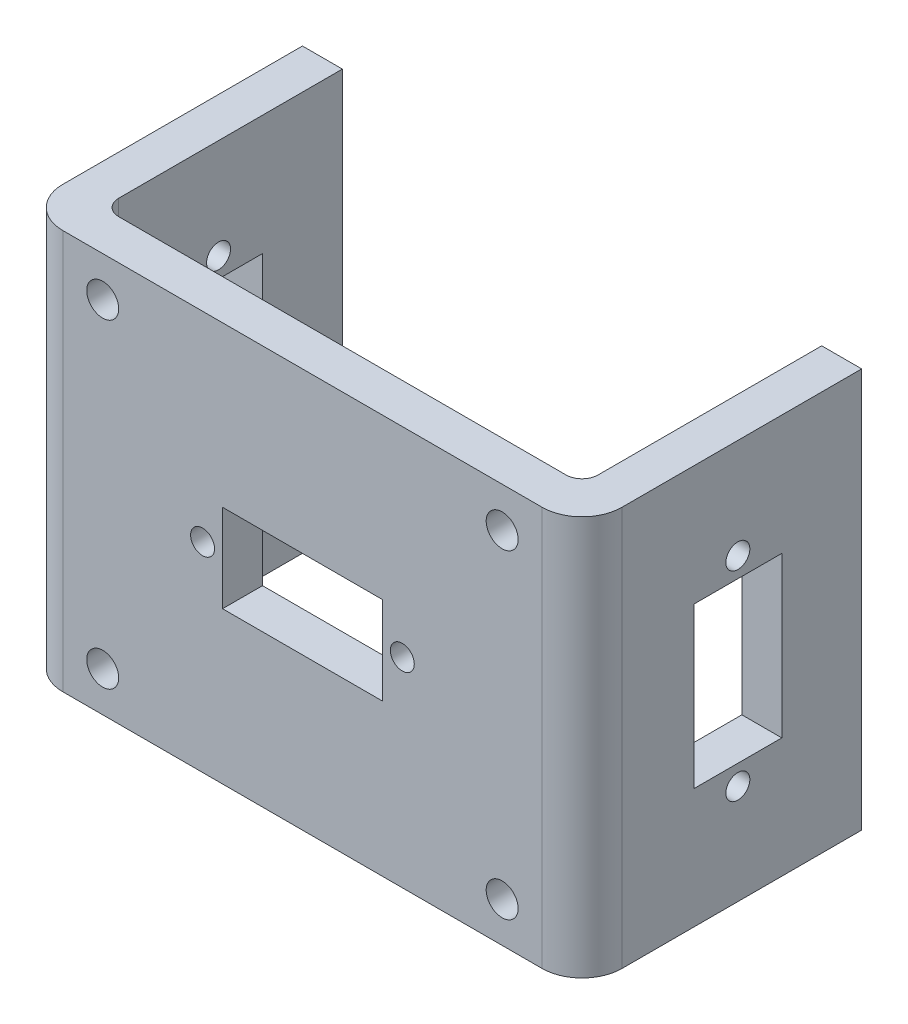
from build123d import *

# Parameters (mm, degrees)
ESQUISSE1_W      = 70
ESQUISSE1_H      = 50
EXTRUSION1_DEPTH = 35
CONG_1_R         = 5
EXTRUSION2_DEPTH = 93.870878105
EXTRUSION3_REACH = 94.871
ESQUISSE3_R      = 2
ESQUISSE5_R      = 1.5
ESQUISSE5_W      = 11
ESQUISSE5_H      = 20
EXTRUSION4_DEPTH = 93.870878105
EXTRUSION6_REACH = 94.871
ESQUISSE7_R      = 1.5
ESQUISSE7_W      = 20
ESQUISSE7_H      = 11


with BuildPart() as part:
    # Esquisse1 → Extrusion1 (new body)
    with BuildSketch(Plane.XY):
        with Locations((35, 25)):
            Rectangle(ESQUISSE1_W, ESQUISSE1_H)
    extrude(amount=EXTRUSION1_DEPTH)

    # Cong_1
    cong_1_edges = [part.edges().sort_by_distance(p)[0] for p in [
        (70, 25, 35),
        (0, 25, 35),
    ]]
    fillet(cong_1_edges, radius=CONG_1_R)

    # Esquisse2 → Extrusion2 (cut, through all)
    with BuildSketch(Plane(origin=(0, 50, 0), x_dir=(1, 0, 0), z_dir=(0, 1, 0))):
        with BuildLine():
            Line((65, 0), (5, 0))
            Line((5, 0), (5, -28))
            ThreePointArc((5, -28), (5.585786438, -29.414213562), (7, -30))
            Line((7, -30), (63, -30))
            ThreePointArc((63, -30), (64.414213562, -29.414213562), (65, -28))
            Line((65, -28), (65, 0))
        make_face()
    extrude(amount=-EXTRUSION2_DEPTH, mode=Mode.SUBTRACT)

    # Esquisse3 → Extrusion3 (cut, up to next)
    with BuildSketch(Plane.XY.offset(35), mode=Mode.PRIVATE) as extrusion3_sk1:
        with Locations((10, 45)):
            Circle(ESQUISSE3_R)
    extrusion3_tool1 = extrude(extrusion3_sk1.sketch, amount=-EXTRUSION3_REACH, mode=Mode.PRIVATE) & part.part
    # Esquisse3 → Extrusion3 (cut, up to next)
    with BuildSketch(Plane.XY.offset(35), mode=Mode.PRIVATE) as extrusion3_sk2:
        with Locations((10, 5)):
            Circle(ESQUISSE3_R)
    extrusion3_tool2 = extrude(extrusion3_sk2.sketch, amount=-EXTRUSION3_REACH, mode=Mode.PRIVATE) & part.part
    # Esquisse3 → Extrusion3 (cut, up to next)
    with BuildSketch(Plane.XY.offset(35), mode=Mode.PRIVATE) as extrusion3_sk3:
        with Locations((60, 5)):
            Circle(ESQUISSE3_R)
    extrusion3_tool3 = extrude(extrusion3_sk3.sketch, amount=-EXTRUSION3_REACH, mode=Mode.PRIVATE) & part.part
    # Esquisse3 → Extrusion3 (cut, up to next)
    with BuildSketch(Plane.XY.offset(35), mode=Mode.PRIVATE) as extrusion3_sk4:
        with Locations((60, 45)):
            Circle(ESQUISSE3_R)
    extrusion3_tool4 = extrude(extrusion3_sk4.sketch, amount=-EXTRUSION3_REACH, mode=Mode.PRIVATE) & part.part
    add(extrusion3_tool1.solids().sort_by_distance((10, 45, 35))[0], mode=Mode.SUBTRACT)
    add(extrusion3_tool2.solids().sort_by_distance((10, 5, 35))[0], mode=Mode.SUBTRACT)
    add(extrusion3_tool3.solids().sort_by_distance((60, 5, 35))[0], mode=Mode.SUBTRACT)
    add(extrusion3_tool4.solids().sort_by_distance((60, 45, 35))[0], mode=Mode.SUBTRACT)

    # Esquisse5 → Extrusion4 (cut, through all)
    with BuildSketch(Plane.ZY):
        with Locations(Location((15.5, 12.5, 0), (0, 0, 270))):
            Circle(ESQUISSE5_R)
        with Locations(Location((15.5, 37.5, 0), (0, 0, 270))):
            Circle(ESQUISSE5_R)
        with Locations((15.5, 25)):
            Rectangle(ESQUISSE5_W, ESQUISSE5_H)
    extrude(amount=-EXTRUSION4_DEPTH, mode=Mode.SUBTRACT)

    # Esquisse7 → Extrusion6 (cut, up to next)
    with BuildSketch(Plane.XY.offset(35), mode=Mode.PRIVATE) as extrusion6_sk1:
        with Locations((22.5, 25)):
            Circle(ESQUISSE7_R)
    extrusion6_tool1 = extrude(extrusion6_sk1.sketch, amount=-EXTRUSION6_REACH, mode=Mode.PRIVATE) & part.part
    # Esquisse7 → Extrusion6 (cut, up to next)
    with BuildSketch(Plane.XY.offset(35), mode=Mode.PRIVATE) as extrusion6_sk2:
        with Locations((47.5, 25)):
            Circle(ESQUISSE7_R)
    extrusion6_tool2 = extrude(extrusion6_sk2.sketch, amount=-EXTRUSION6_REACH, mode=Mode.PRIVATE) & part.part
    # Esquisse7 → Extrusion6 (cut, up to next)
    with BuildSketch(Plane.XY.offset(35), mode=Mode.PRIVATE) as extrusion6_sk3:
        with Locations((35, 24.5)):
            Rectangle(ESQUISSE7_W, ESQUISSE7_H)
    extrusion6_tool3 = extrude(extrusion6_sk3.sketch, amount=-EXTRUSION6_REACH, mode=Mode.PRIVATE) & part.part
    add(extrusion6_tool1.solids().sort_by_distance((22.5, 25, 35))[0], mode=Mode.SUBTRACT)
    add(extrusion6_tool2.solids().sort_by_distance((47.5, 25, 35))[0], mode=Mode.SUBTRACT)
    add(extrusion6_tool3.solids().sort_by_distance((35, 24.5, 35))[0], mode=Mode.SUBTRACT)


solid = part.part
